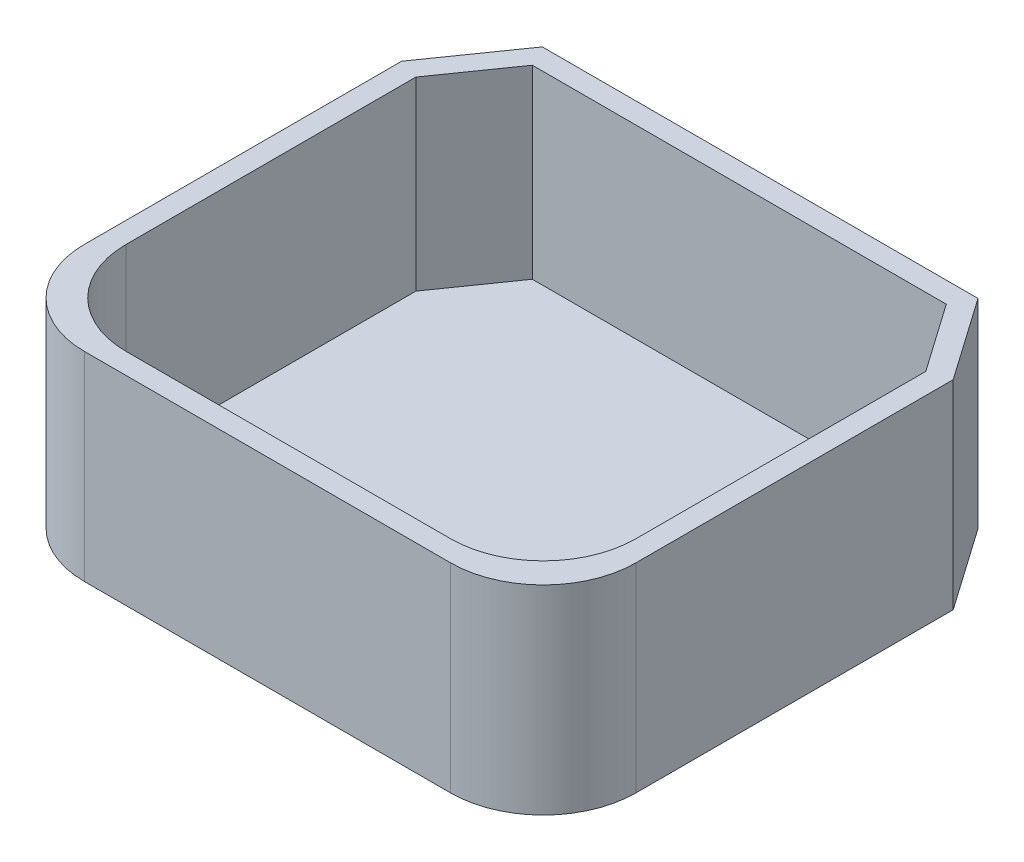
from build123d import *

# Parameters (mm, degrees)
EXTRUDE_1_DEPTH = 0.3
EXTRUDE_2_DEPTH = 4
FILLET_2_R      = 2
SKETCH_4_W      = 0.3
SKETCH_4_H      = 1.6
EXTRUDE_4_DEPTH = 2


with BuildPart() as part:
    # Sketch 1 → Extrude 1 (new body)
    with BuildSketch(Plane(origin=(0, 0, 0), x_dir=(1, 0, 0), z_dir=(0, 1, 0))):
        Polygon((4.7, 5.315), (5.95, 3.529814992), (5.95, -5.315), (-5.95, -5.315), (-5.95, 3.529814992), (-4.7, 5.315), align=None)
    extrude(amount=EXTRUDE_1_DEPTH)

    # Sketch 2 → Extrude 2 (add)
    with BuildSketch(Plane(origin=(0, 0.3, 0), x_dir=(1, 0, 0), z_dir=(0, 1, 0))):
        Polygon((-4.7, 5.315), (-5.95, 3.529814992), (-5.95, -5.315), (5.95, -5.315), (5.95, 3.529814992), (4.7, 5.315), align=None)
        Polygon((-4.465744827, 4.865), (-5.5, 3.387930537), (-5.5, -4.865), (5.5, -4.865), (5.5, 3.387930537), (4.465744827, 4.865), align=None, mode=Mode.SUBTRACT)
    extrude(amount=EXTRUDE_2_DEPTH)

    # Fillet 2
    fillet_2_edges = [part.edges().sort_by_distance(p)[0] for p in [
        (5.95, 2.15, 5.315),
        (-5.95, 2.15, 5.315),
        (-5.5, 2.3, 4.865),
        (5.5, 2.3, 4.865),
    ]]
    fillet(fillet_2_edges, radius=FILLET_2_R)

    # Sketch 4 → Extrude 4 (add)
    with BuildSketch(Plane(origin=(0, 0.3, 0), x_dir=(1, 0, 0), z_dir=(0, 1, 0))):
        with Locations((-4.55, -4.065)):
            Rectangle(SKETCH_4_W, SKETCH_4_H)
        with Locations((4.55, -4.065)):
            Rectangle(SKETCH_4_W, SKETCH_4_H)
    extrude(amount=EXTRUDE_4_DEPTH)


solid = part.part
